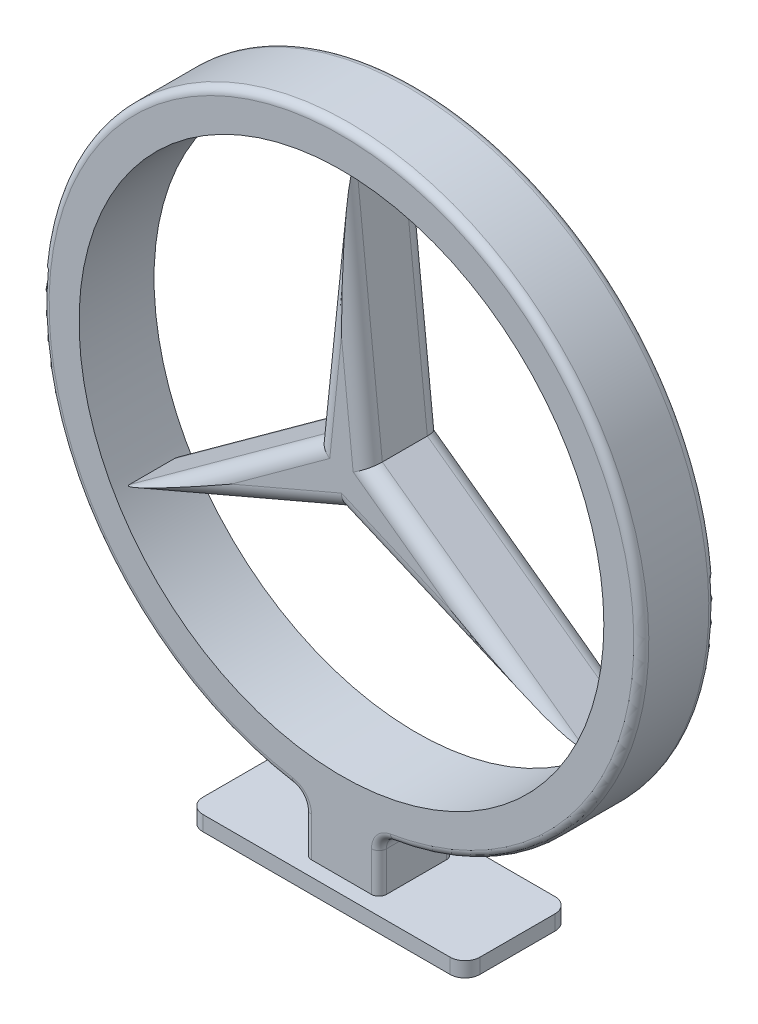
ISO-10303-21;
HEADER;
FILE_DESCRIPTION(('STEP AP214'),'2;1');
FILE_NAME('part.step','',(''),(''),'','','');
FILE_SCHEMA(('AUTOMOTIVE_DESIGN { 1 0 10303 214 1 1 1 1 }'));
ENDSEC;
DATA;
#1=APPLICATION_CONTEXT('core data for automotive mechanical design processes');
#2=APPLICATION_PROTOCOL_DEFINITION('international standard','automotive_design',2000,#1);
#3=PRODUCT_CONTEXT('',#1,'mechanical');
#4=PRODUCT('Part','Part','',(#3));
#5=PRODUCT_RELATED_PRODUCT_CATEGORY('part','',(#4));
#6=PRODUCT_DEFINITION_FORMATION('','',#4);
#7=PRODUCT_DEFINITION_CONTEXT('part definition',#1,'design');
#8=PRODUCT_DEFINITION('design','',#6,#7);
#9=PRODUCT_DEFINITION_SHAPE('','',#8);
#10=(LENGTH_UNIT() NAMED_UNIT(*) SI_UNIT(.MILLI.,.METRE.));
#11=(NAMED_UNIT(*) PLANE_ANGLE_UNIT() SI_UNIT($,.RADIAN.));
#12=(NAMED_UNIT(*) SI_UNIT($,.STERADIAN.) SOLID_ANGLE_UNIT());
#13=UNCERTAINTY_MEASURE_WITH_UNIT(LENGTH_MEASURE(1.E-05),#10,'distance_accuracy_value','');
#14=(GEOMETRIC_REPRESENTATION_CONTEXT(3) GLOBAL_UNCERTAINTY_ASSIGNED_CONTEXT((#13)) GLOBAL_UNIT_ASSIGNED_CONTEXT((#10,
#11,#12)) REPRESENTATION_CONTEXT('',''));
#15=CARTESIAN_POINT('',(0.,0.,0.));
#16=DIRECTION('',(0.,0.,1.));
#17=DIRECTION('',(1.,0.,0.));
#18=AXIS2_PLACEMENT_3D('',#15,#16,#17);
#19=CARTESIAN_POINT('',(-30.3108891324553,-17.5000000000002,-80.1950746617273));
#20=DIRECTION('',(-0.587398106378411,0.809298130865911,0.));
#21=DIRECTION('',(-0.809298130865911,-0.587398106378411,0.));
#22=AXIS2_PLACEMENT_3D('',#19,#20,#21);
#23=PLANE('',#22);
#24=DIRECTION('',(0.,0.,1.));
#25=VECTOR('',#24,1.);
#26=CARTESIAN_POINT('',(-3.45313926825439,1.99367088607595,-80.1950746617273));
#27=LINE('',#26,#25);
#28=CARTESIAN_POINT('',(-3.45313926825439,1.99367088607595,2.));
#29=VERTEX_POINT('',#28);
#30=CARTESIAN_POINT('',(-3.45313926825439,1.99367088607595,7.99999999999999));
#31=VERTEX_POINT('',#30);
#32=EDGE_CURVE('E156',#29,#31,#27,.T.);
#33=ORIENTED_EDGE('',*,*,#32,.F.);
#34=DIRECTION('',(0.809298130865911,0.587398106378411,0.));
#35=VECTOR('',#34,1.);
#36=CARTESIAN_POINT('',(-30.3108891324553,-17.5000000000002,2.));
#37=LINE('',#36,#35);
#38=CARTESIAN_POINT('',(-30.3108891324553,-17.5000000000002,2.));
#39=VERTEX_POINT('',#38);
#40=EDGE_CURVE('E176',#29,#39,#37,.F.);
#41=ORIENTED_EDGE('',*,*,#40,.T.);
#42=DIRECTION('',(0.,0.,1.));
#43=VECTOR('',#42,1.);
#44=CARTESIAN_POINT('',(-30.3108891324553,-17.5000000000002,-80.1950746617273));
#45=LINE('',#44,#43);
#46=CARTESIAN_POINT('',(-30.3108891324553,-17.5000000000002,7.99999999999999));
#47=VERTEX_POINT('',#46);
#48=EDGE_CURVE('E210',#39,#47,#45,.T.);
#49=ORIENTED_EDGE('',*,*,#48,.T.);
#50=DIRECTION('',(-0.809298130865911,-0.587398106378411,0.));
#51=VECTOR('',#50,1.);
#52=CARTESIAN_POINT('',(-3.45313926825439,1.99367088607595,8.));
#53=LINE('',#52,#51);
#54=EDGE_CURVE('E174',#47,#31,#53,.F.);
#55=ORIENTED_EDGE('',*,*,#54,.T.);
#56=EDGE_LOOP('',(#33,#41,#49,#55));
#57=FACE_BOUND('',#56,.T.);
#58=ADVANCED_FACE('F47',(#57),#23,.T.);
#59=CARTESIAN_POINT('',(0.,35.,-80.1950746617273));
#60=DIRECTION('',(-0.994571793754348,0.104052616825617,0.));
#61=DIRECTION('',(-0.104052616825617,-0.994571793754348,0.));
#62=AXIS2_PLACEMENT_3D('',#59,#60,#61);
#63=PLANE('',#62);
#64=DIRECTION('',(0.,0.,1.));
#65=VECTOR('',#64,1.);
#66=CARTESIAN_POINT('',(0.,35.,-80.1950746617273));
#67=LINE('',#66,#65);
#68=CARTESIAN_POINT('',(0.,35.,2.));
#69=VERTEX_POINT('',#68);
#70=CARTESIAN_POINT('',(0.,35.,7.99999999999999));
#71=VERTEX_POINT('',#70);
#72=EDGE_CURVE('E239',#69,#71,#67,.T.);
#73=ORIENTED_EDGE('',*,*,#72,.F.);
#74=DIRECTION('',(0.104052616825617,0.994571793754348,0.));
#75=VECTOR('',#74,1.);
#76=CARTESIAN_POINT('',(-3.45313926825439,1.99367088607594,2.));
#77=LINE('',#76,#75);
#78=EDGE_CURVE('E172',#69,#29,#77,.F.);
#79=ORIENTED_EDGE('',*,*,#78,.T.);
#80=ORIENTED_EDGE('',*,*,#32,.T.);
#81=DIRECTION('',(-0.104052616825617,-0.994571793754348,0.));
#82=VECTOR('',#81,1.);
#83=CARTESIAN_POINT('',(0.,35.,8.));
#84=LINE('',#83,#82);
#85=EDGE_CURVE('E170',#31,#71,#84,.F.);
#86=ORIENTED_EDGE('',*,*,#85,.T.);
#87=EDGE_LOOP('',(#73,#79,#80,#86));
#88=FACE_BOUND('',#87,.T.);
#89=ADVANCED_FACE('F238',(#88),#63,.T.);
#90=CARTESIAN_POINT('',(0.,35.,-80.1950746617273));
#91=DIRECTION('',(0.994571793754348,0.104052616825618,0.));
#92=DIRECTION('',(-0.104052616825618,0.994571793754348,0.));
#93=AXIS2_PLACEMENT_3D('',#90,#91,#92);
#94=PLANE('',#93);
#95=DIRECTION('',(0.,0.,1.));
#96=VECTOR('',#95,1.);
#97=CARTESIAN_POINT('',(3.45313926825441,1.99367088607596,-80.1950746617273));
#98=LINE('',#97,#96);
#99=CARTESIAN_POINT('',(3.45313926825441,1.99367088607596,2.));
#100=VERTEX_POINT('',#99);
#101=CARTESIAN_POINT('',(3.45313926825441,1.99367088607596,7.99999999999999));
#102=VERTEX_POINT('',#101);
#103=EDGE_CURVE('E245',#100,#102,#98,.T.);
#104=ORIENTED_EDGE('',*,*,#103,.F.);
#105=DIRECTION('',(0.104052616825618,-0.994571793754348,0.));
#106=VECTOR('',#105,1.);
#107=CARTESIAN_POINT('',(0.,35.,2.));
#108=LINE('',#107,#106);
#109=EDGE_CURVE('E143',#100,#69,#108,.F.);
#110=ORIENTED_EDGE('',*,*,#109,.T.);
#111=ORIENTED_EDGE('',*,*,#72,.T.);
#112=DIRECTION('',(-0.104052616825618,0.994571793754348,0.));
#113=VECTOR('',#112,1.);
#114=CARTESIAN_POINT('',(3.45313926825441,1.99367088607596,8.));
#115=LINE('',#114,#113);
#116=EDGE_CURVE('E162',#71,#102,#115,.F.);
#117=ORIENTED_EDGE('',*,*,#116,.T.);
#118=EDGE_LOOP('',(#104,#110,#111,#117));
#119=FACE_BOUND('',#118,.T.);
#120=ADVANCED_FACE('F243',(#119),#94,.T.);
#121=CARTESIAN_POINT('',(3.45313926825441,1.99367088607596,-80.1950746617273));
#122=DIRECTION('',(0.587398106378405,0.809298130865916,0.));
#123=DIRECTION('',(-0.809298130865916,0.587398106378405,0.));
#124=AXIS2_PLACEMENT_3D('',#121,#122,#123);
#125=PLANE('',#124);
#126=DIRECTION('',(0.,0.,1.));
#127=VECTOR('',#126,1.);
#128=CARTESIAN_POINT('',(30.3108891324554,-17.4999999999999,-80.1950746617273));
#129=LINE('',#128,#127);
#130=CARTESIAN_POINT('',(30.3108891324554,-17.4999999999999,2.));
#131=VERTEX_POINT('',#130);
#132=CARTESIAN_POINT('',(30.3108891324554,-17.4999999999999,7.99999999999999));
#133=VERTEX_POINT('',#132);
#134=EDGE_CURVE('E248',#131,#133,#129,.T.);
#135=ORIENTED_EDGE('',*,*,#134,.F.);
#136=DIRECTION('',(0.809298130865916,-0.587398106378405,0.));
#137=VECTOR('',#136,1.);
#138=CARTESIAN_POINT('',(3.45313926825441,1.99367088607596,2.));
#139=LINE('',#138,#137);
#140=EDGE_CURVE('E189',#131,#100,#139,.F.);
#141=ORIENTED_EDGE('',*,*,#140,.T.);
#142=ORIENTED_EDGE('',*,*,#103,.T.);
#143=DIRECTION('',(-0.809298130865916,0.587398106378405,0.));
#144=VECTOR('',#143,1.);
#145=CARTESIAN_POINT('',(30.3108891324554,-17.4999999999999,8.));
#146=LINE('',#145,#144);
#147=EDGE_CURVE('E187',#102,#133,#146,.F.);
#148=ORIENTED_EDGE('',*,*,#147,.T.);
#149=EDGE_LOOP('',(#135,#141,#142,#148));
#150=FACE_BOUND('',#149,.T.);
#151=ADVANCED_FACE('F288',(#150),#125,.T.);
#152=CARTESIAN_POINT('',(0.,-4.5,-80.1950746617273));
#153=DIRECTION('',(-0.394165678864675,-0.919039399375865,0.));
#154=DIRECTION('',(0.919039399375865,-0.394165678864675,0.));
#155=AXIS2_PLACEMENT_3D('',#152,#153,#154);
#156=PLANE('',#155);
#157=DIRECTION('',(0.,0.,1.));
#158=VECTOR('',#157,1.);
#159=CARTESIAN_POINT('',(0.,-4.5,-80.1950746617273));
#160=LINE('',#159,#158);
#161=CARTESIAN_POINT('',(0.,-4.5,2.));
#162=VERTEX_POINT('',#161);
#163=CARTESIAN_POINT('',(0.,-4.5,7.99999999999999));
#164=VERTEX_POINT('',#163);
#165=EDGE_CURVE('E253',#162,#164,#160,.T.);
#166=ORIENTED_EDGE('',*,*,#165,.F.);
#167=DIRECTION('',(-0.919039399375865,0.394165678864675,0.));
#168=VECTOR('',#167,1.);
#169=CARTESIAN_POINT('',(30.3108891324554,-17.4999999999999,2.));
#170=LINE('',#169,#168);
#171=EDGE_CURVE('E185',#162,#131,#170,.F.);
#172=ORIENTED_EDGE('',*,*,#171,.T.);
#173=ORIENTED_EDGE('',*,*,#134,.T.);
#174=DIRECTION('',(0.919039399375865,-0.394165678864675,0.));
#175=VECTOR('',#174,1.);
#176=CARTESIAN_POINT('',(0.,-4.5,8.));
#177=LINE('',#176,#175);
#178=EDGE_CURVE('E182',#133,#164,#177,.F.);
#179=ORIENTED_EDGE('',*,*,#178,.T.);
#180=EDGE_LOOP('',(#166,#172,#173,#179));
#181=FACE_BOUND('',#180,.T.);
#182=ADVANCED_FACE('F285',(#181),#156,.T.);
#183=CARTESIAN_POINT('',(-30.3108891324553,-17.5000000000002,-80.1950746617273));
#184=DIRECTION('',(0.394165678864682,-0.919039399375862,0.));
#185=DIRECTION('',(0.919039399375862,0.394165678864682,0.));
#186=AXIS2_PLACEMENT_3D('',#183,#184,#185);
#187=PLANE('',#186);
#188=ORIENTED_EDGE('',*,*,#48,.F.);
#189=DIRECTION('',(-0.919039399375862,-0.394165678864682,0.));
#190=VECTOR('',#189,1.);
#191=CARTESIAN_POINT('',(0.,-4.5,2.));
#192=LINE('',#191,#190);
#193=EDGE_CURVE('E180',#39,#162,#192,.F.);
#194=ORIENTED_EDGE('',*,*,#193,.T.);
#195=ORIENTED_EDGE('',*,*,#165,.T.);
#196=DIRECTION('',(0.919039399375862,0.394165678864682,0.));
#197=VECTOR('',#196,1.);
#198=CARTESIAN_POINT('',(-30.3108891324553,-17.5000000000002,8.));
#199=LINE('',#198,#197);
#200=EDGE_CURVE('E178',#164,#47,#199,.F.);
#201=ORIENTED_EDGE('',*,*,#200,.T.);
#202=EDGE_LOOP('',(#188,#194,#195,#201));
#203=FACE_BOUND('',#202,.T.);
#204=ADVANCED_FACE('F274',(#203),#187,.T.);
#205=CARTESIAN_POINT('',(0.,0.,10.));
#206=DIRECTION('',(0.,0.,-1.));
#207=DIRECTION('',(-1.,0.,0.));
#208=AXIS2_PLACEMENT_3D('',#205,#206,#207);
#209=PLANE('',#208);
#210=DIRECTION('',(0.919039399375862,0.394165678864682,0.));
#211=VECTOR('',#210,1.);
#212=CARTESIAN_POINT('',(-0.78833135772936,-2.66192120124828,10.));
#213=LINE('',#212,#211);
#214=CARTESIAN_POINT('',(-14.6588092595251,-8.61081342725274,10.));
#215=VERTEX_POINT('',#214);
#216=CARTESIAN_POINT('',(0.,-2.3238147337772,10.));
#217=VERTEX_POINT('',#216);
#218=EDGE_CURVE('E56',#215,#217,#213,.T.);
#219=ORIENTED_EDGE('',*,*,#218,.T.);
#220=DIRECTION('',(0.919039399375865,-0.394165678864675,0.));
#221=VECTOR('',#220,1.);
#222=CARTESIAN_POINT('',(31.0992204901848,-15.6619212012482,10.));
#223=LINE('',#222,#221);
#224=CARTESIAN_POINT('',(14.6588092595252,-8.61081342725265,10.));
#225=VERTEX_POINT('',#224);
#226=EDGE_CURVE('E12',#217,#225,#223,.T.);
#227=ORIENTED_EDGE('',*,*,#226,.T.);
#228=DIRECTION('',(-0.809298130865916,0.587398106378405,0.));
#229=VECTOR('',#228,1.);
#230=CARTESIAN_POINT('',(2.2783430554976,0.375074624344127,10.));
#231=LINE('',#230,#229);
#232=CARTESIAN_POINT('',(1.55676943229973,0.898801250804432,10.));
#233=VERTEX_POINT('',#232);
#234=EDGE_CURVE('E191',#225,#233,#231,.T.);
#235=ORIENTED_EDGE('',*,*,#234,.T.);
#236=DIRECTION('',(-0.104052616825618,0.994571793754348,0.));
#237=VECTOR('',#236,1.);
#238=CARTESIAN_POINT('',(-1.9891435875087,34.7918947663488,10.));
#239=LINE('',#238,#237);
#240=CARTESIAN_POINT('',(0.,15.7789552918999,10.));
#241=VERTEX_POINT('',#240);
#242=EDGE_CURVE('E193',#233,#241,#239,.T.);
#243=ORIENTED_EDGE('',*,*,#242,.T.);
#244=DIRECTION('',(-0.104052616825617,-0.994571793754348,0.));
#245=VECTOR('',#244,1.);
#246=CARTESIAN_POINT('',(-1.46399568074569,1.78556565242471,10.));
#247=LINE('',#246,#245);
#248=CARTESIAN_POINT('',(-1.55676943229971,0.89880125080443,10.));
#249=VERTEX_POINT('',#248);
#250=EDGE_CURVE('E195',#241,#249,#247,.T.);
#251=ORIENTED_EDGE('',*,*,#250,.T.);
#252=DIRECTION('',(-0.809298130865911,-0.587398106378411,0.));
#253=VECTOR('',#252,1.);
#254=CARTESIAN_POINT('',(-29.1360929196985,-19.118596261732,10.));
#255=LINE('',#254,#253);
#256=EDGE_CURVE('E67',#249,#215,#255,.T.);
#257=ORIENTED_EDGE('',*,*,#256,.T.);
#258=EDGE_LOOP('',(#219,#227,#235,#243,#251,#257));
#259=FACE_BOUND('',#258,.T.);
#260=ADVANCED_FACE('F406',(#259),#209,.F.);
#261=CARTESIAN_POINT('',(0.,0.,0.));
#262=DIRECTION('',(0.,0.,1.));
#263=DIRECTION('',(1.,0.,0.));
#264=AXIS2_PLACEMENT_3D('',#261,#262,#263);
#265=PLANE('',#264);
#266=DIRECTION('',(0.104052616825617,0.994571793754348,0.));
#267=VECTOR('',#266,1.);
#268=CARTESIAN_POINT('',(1.9891435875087,34.7918947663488,0.));
#269=LINE('',#268,#267);
#270=CARTESIAN_POINT('',(-1.55676943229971,0.89880125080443,0.));
#271=VERTEX_POINT('',#270);
#272=CARTESIAN_POINT('',(0.,15.7789552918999,0.));
#273=VERTEX_POINT('',#272);
#274=EDGE_CURVE('E160',#271,#273,#269,.T.);
#275=ORIENTED_EDGE('',*,*,#274,.T.);
#276=DIRECTION('',(0.104052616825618,-0.994571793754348,0.));
#277=VECTOR('',#276,1.);
#278=CARTESIAN_POINT('',(1.46399568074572,1.78556565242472,0.));
#279=LINE('',#278,#277);
#280=CARTESIAN_POINT('',(1.55676943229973,0.898801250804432,0.));
#281=VERTEX_POINT('',#280);
#282=EDGE_CURVE('E141',#273,#281,#279,.T.);
#283=ORIENTED_EDGE('',*,*,#282,.T.);
#284=DIRECTION('',(0.809298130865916,-0.587398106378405,0.));
#285=VECTOR('',#284,1.);
#286=CARTESIAN_POINT('',(29.1360929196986,-19.1185962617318,0.));
#287=LINE('',#286,#285);
#288=CARTESIAN_POINT('',(14.6588092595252,-8.61081342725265,0.));
#289=VERTEX_POINT('',#288);
#290=EDGE_CURVE('E149',#281,#289,#287,.T.);
#291=ORIENTED_EDGE('',*,*,#290,.T.);
#292=DIRECTION('',(-0.919039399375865,0.394165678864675,0.));
#293=VECTOR('',#292,1.);
#294=CARTESIAN_POINT('',(0.788331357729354,-2.66192120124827,0.));
#295=LINE('',#294,#293);
#296=CARTESIAN_POINT('',(0.,-2.3238147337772,0.));
#297=VERTEX_POINT('',#296);
#298=EDGE_CURVE('E155',#289,#297,#295,.T.);
#299=ORIENTED_EDGE('',*,*,#298,.T.);
#300=DIRECTION('',(-0.919039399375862,-0.394165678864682,0.));
#301=VECTOR('',#300,1.);
#302=CARTESIAN_POINT('',(-31.0992204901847,-15.6619212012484,0.));
#303=LINE('',#302,#301);
#304=CARTESIAN_POINT('',(-14.6588092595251,-8.61081342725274,0.));
#305=VERTEX_POINT('',#304);
#306=EDGE_CURVE('E259',#297,#305,#303,.T.);
#307=ORIENTED_EDGE('',*,*,#306,.T.);
#308=DIRECTION('',(0.809298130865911,0.587398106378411,0.));
#309=VECTOR('',#308,1.);
#310=CARTESIAN_POINT('',(-2.27834305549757,0.375074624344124,0.));
#311=LINE('',#310,#309);
#312=EDGE_CURVE('E165',#305,#271,#311,.T.);
#313=ORIENTED_EDGE('',*,*,#312,.T.);
#314=EDGE_LOOP('',(#275,#283,#291,#299,#307,#313));
#315=FACE_BOUND('',#314,.T.);
#316=ADVANCED_FACE('F158',(#315),#265,.F.);
#317=CARTESIAN_POINT('',(0.841810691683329,-1.96277158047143,2.));
#318=DIRECTION('',(0.919039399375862,0.394165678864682,0.));
#319=DIRECTION('',(-0.394165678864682,0.919039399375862,0.));
#320=AXIS2_PLACEMENT_3D('',#317,#318,#319);
#321=CYLINDRICAL_SURFACE('',#320,2.);
#322=CARTESIAN_POINT('',(0.,-2.3238147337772,2.));
#323=DIRECTION('',(1.,0.,0.));
#324=DIRECTION('',(0.,1.,0.));
#325=AXIS2_PLACEMENT_3D('',#322,#323,#324);
#326=ELLIPSE('',#325,2.17618526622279,2.);
#327=EDGE_CURVE('E204',#162,#297,#326,.T.);
#328=ORIENTED_EDGE('',*,*,#327,.F.);
#329=ORIENTED_EDGE('',*,*,#193,.F.);
#330=CARTESIAN_POINT('',(-14.6588092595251,-8.61081342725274,2.));
#331=DIRECTION('',(0.493839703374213,-0.869552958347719,0.));
#332=DIRECTION('',(0.869552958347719,0.493839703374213,0.));
#333=AXIS2_PLACEMENT_3D('',#330,#331,#332);
#334=ELLIPSE('',#333,18.0001456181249,2.);
#335=EDGE_CURVE('E207',#305,#39,#334,.F.);
#336=ORIENTED_EDGE('',*,*,#335,.F.);
#337=ORIENTED_EDGE('',*,*,#306,.F.);
#338=EDGE_LOOP('',(#328,#329,#336,#337));
#339=FACE_BOUND('',#338,.T.);
#340=ADVANCED_FACE('F279',(#339),#321,.T.);
#341=CARTESIAN_POINT('',(-0.964414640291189,1.32873932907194,2.));
#342=DIRECTION('',(-0.809298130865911,-0.587398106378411,0.));
#343=DIRECTION('',(0.587398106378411,-0.809298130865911,0.));
#344=AXIS2_PLACEMENT_3D('',#341,#342,#343);
#345=CYLINDRICAL_SURFACE('',#344,2.);
#346=ORIENTED_EDGE('',*,*,#335,.T.);
#347=ORIENTED_EDGE('',*,*,#40,.F.);
#348=CARTESIAN_POINT('',(-1.55676943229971,0.898801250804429,2.));
#349=DIRECTION('',(-0.499999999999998,-0.86602540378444,0.));
#350=DIRECTION('',(0.86602540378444,-0.499999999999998,0.));
#351=AXIS2_PLACEMENT_3D('',#348,#349,#350);
#352=ELLIPSE('',#351,2.18973927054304,2.);
#353=EDGE_CURVE('E201',#271,#29,#352,.F.);
#354=ORIENTED_EDGE('',*,*,#353,.F.);
#355=ORIENTED_EDGE('',*,*,#312,.F.);
#356=EDGE_LOOP('',(#346,#347,#354,#355));
#357=FACE_BOUND('',#356,.T.);
#358=ADVANCED_FACE('F266',(#357),#345,.T.);
#359=CARTESIAN_POINT('',(-0.841810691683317,-1.96277158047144,2.));
#360=DIRECTION('',(0.919039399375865,-0.394165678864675,0.));
#361=DIRECTION('',(0.394165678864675,0.919039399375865,0.));
#362=AXIS2_PLACEMENT_3D('',#359,#360,#361);
#363=CYLINDRICAL_SURFACE('',#362,2.);
#364=ORIENTED_EDGE('',*,*,#327,.T.);
#365=ORIENTED_EDGE('',*,*,#298,.F.);
#366=CARTESIAN_POINT('',(14.6588092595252,-8.61081342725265,2.));
#367=DIRECTION('',(0.493839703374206,0.869552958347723,0.));
#368=DIRECTION('',(-0.869552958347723,0.493839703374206,0.));
#369=AXIS2_PLACEMENT_3D('',#366,#367,#368);
#370=ELLIPSE('',#369,18.0001456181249,2.);
#371=EDGE_CURVE('E152',#131,#289,#370,.T.);
#372=ORIENTED_EDGE('',*,*,#371,.F.);
#373=ORIENTED_EDGE('',*,*,#171,.F.);
#374=EDGE_LOOP('',(#364,#365,#372,#373));
#375=FACE_BOUND('',#374,.T.);
#376=ADVANCED_FACE('F282',(#375),#363,.T.);
#377=CARTESIAN_POINT('',(-1.63292933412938,0.17083791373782,2.));
#378=DIRECTION('',(-0.104052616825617,-0.994571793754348,0.));
#379=DIRECTION('',(0.994571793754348,-0.104052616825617,0.));
#380=AXIS2_PLACEMENT_3D('',#377,#378,#379);
#381=CYLINDRICAL_SURFACE('',#380,2.);
#382=ORIENTED_EDGE('',*,*,#353,.T.);
#383=ORIENTED_EDGE('',*,*,#78,.F.);
#384=CARTESIAN_POINT('',(0.,15.7789552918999,2.));
#385=DIRECTION('',(-1.,0.,0.));
#386=DIRECTION('',(0.,-1.,0.));
#387=AXIS2_PLACEMENT_3D('',#384,#385,#386);
#388=ELLIPSE('',#387,19.2210447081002,2.);
#389=EDGE_CURVE('E146',#273,#69,#388,.F.);
#390=ORIENTED_EDGE('',*,*,#389,.F.);
#391=ORIENTED_EDGE('',*,*,#274,.F.);
#392=EDGE_LOOP('',(#382,#383,#390,#391));
#393=FACE_BOUND('',#392,.T.);
#394=ADVANCED_FACE('F269',(#393),#381,.T.);
#395=CARTESIAN_POINT('',(0.964414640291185,1.32873932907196,2.));
#396=DIRECTION('',(-0.809298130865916,0.587398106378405,0.));
#397=DIRECTION('',(-0.587398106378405,-0.809298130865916,0.));
#398=AXIS2_PLACEMENT_3D('',#395,#396,#397);
#399=CYLINDRICAL_SURFACE('',#398,2.);
#400=ORIENTED_EDGE('',*,*,#371,.T.);
#401=ORIENTED_EDGE('',*,*,#290,.F.);
#402=CARTESIAN_POINT('',(1.55676943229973,0.898801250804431,2.));
#403=DIRECTION('',(-0.500000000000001,0.866025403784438,0.));
#404=DIRECTION('',(0.866025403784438,0.500000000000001,0.));
#405=AXIS2_PLACEMENT_3D('',#402,#403,#404);
#406=ELLIPSE('',#405,2.18973927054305,2.);
#407=EDGE_CURVE('E137',#100,#281,#406,.T.);
#408=ORIENTED_EDGE('',*,*,#407,.F.);
#409=ORIENTED_EDGE('',*,*,#140,.F.);
#410=EDGE_LOOP('',(#400,#401,#408,#409));
#411=FACE_BOUND('',#410,.T.);
#412=ADVANCED_FACE('F150',(#411),#399,.T.);
#413=CARTESIAN_POINT('',(1.6329293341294,0.170837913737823,2.));
#414=DIRECTION('',(-0.104052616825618,0.994571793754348,0.));
#415=DIRECTION('',(-0.994571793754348,-0.104052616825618,0.));
#416=AXIS2_PLACEMENT_3D('',#413,#414,#415);
#417=CYLINDRICAL_SURFACE('',#416,2.);
#418=ORIENTED_EDGE('',*,*,#389,.T.);
#419=ORIENTED_EDGE('',*,*,#109,.F.);
#420=ORIENTED_EDGE('',*,*,#407,.T.);
#421=ORIENTED_EDGE('',*,*,#282,.F.);
#422=EDGE_LOOP('',(#418,#419,#420,#421));
#423=FACE_BOUND('',#422,.T.);
#424=ADVANCED_FACE('F139',(#423),#417,.T.);
#425=CARTESIAN_POINT('',(-1.63292933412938,0.17083791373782,8.));
#426=DIRECTION('',(0.104052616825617,0.994571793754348,0.));
#427=DIRECTION('',(-0.994571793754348,0.104052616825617,0.));
#428=AXIS2_PLACEMENT_3D('',#425,#426,#427);
#429=CYLINDRICAL_SURFACE('',#428,2.);
#430=CARTESIAN_POINT('',(0.,15.7789552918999,8.));
#431=DIRECTION('',(1.,0.,0.));
#432=DIRECTION('',(0.,-1.,0.));
#433=AXIS2_PLACEMENT_3D('',#430,#431,#432);
#434=ELLIPSE('',#433,19.2210447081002,2.);
#435=EDGE_CURVE('E220',#71,#241,#434,.T.);
#436=ORIENTED_EDGE('',*,*,#435,.F.);
#437=ORIENTED_EDGE('',*,*,#85,.F.);
#438=CARTESIAN_POINT('',(-1.55676943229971,0.898801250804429,8.));
#439=DIRECTION('',(0.499999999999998,0.86602540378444,0.));
#440=DIRECTION('',(0.86602540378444,-0.499999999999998,0.));
#441=AXIS2_PLACEMENT_3D('',#438,#439,#440);
#442=ELLIPSE('',#441,2.18973927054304,2.);
#443=EDGE_CURVE('E51',#249,#31,#442,.F.);
#444=ORIENTED_EDGE('',*,*,#443,.F.);
#445=ORIENTED_EDGE('',*,*,#250,.F.);
#446=EDGE_LOOP('',(#436,#437,#444,#445));
#447=FACE_BOUND('',#446,.T.);
#448=ADVANCED_FACE('F49',(#447),#429,.T.);
#449=CARTESIAN_POINT('',(-0.964414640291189,1.32873932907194,8.));
#450=DIRECTION('',(0.809298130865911,0.587398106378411,0.));
#451=DIRECTION('',(-0.587398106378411,0.809298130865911,0.));
#452=AXIS2_PLACEMENT_3D('',#449,#450,#451);
#453=CYLINDRICAL_SURFACE('',#452,2.);
#454=ORIENTED_EDGE('',*,*,#443,.T.);
#455=ORIENTED_EDGE('',*,*,#54,.F.);
#456=CARTESIAN_POINT('',(-14.6588092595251,-8.61081342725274,8.));
#457=DIRECTION('',(-0.493839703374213,0.869552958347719,0.));
#458=DIRECTION('',(0.869552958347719,0.493839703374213,0.));
#459=AXIS2_PLACEMENT_3D('',#456,#457,#458);
#460=ELLIPSE('',#459,18.0001456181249,2.);
#461=EDGE_CURVE('E218',#215,#47,#460,.F.);
#462=ORIENTED_EDGE('',*,*,#461,.F.);
#463=ORIENTED_EDGE('',*,*,#256,.F.);
#464=EDGE_LOOP('',(#454,#455,#462,#463));
#465=FACE_BOUND('',#464,.T.);
#466=ADVANCED_FACE('F230',(#465),#453,.T.);
#467=CARTESIAN_POINT('',(1.6329293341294,0.170837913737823,8.));
#468=DIRECTION('',(0.104052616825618,-0.994571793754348,0.));
#469=DIRECTION('',(0.994571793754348,0.104052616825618,0.));
#470=AXIS2_PLACEMENT_3D('',#467,#468,#469);
#471=CYLINDRICAL_SURFACE('',#470,2.);
#472=ORIENTED_EDGE('',*,*,#435,.T.);
#473=ORIENTED_EDGE('',*,*,#242,.F.);
#474=CARTESIAN_POINT('',(1.55676943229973,0.898801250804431,8.));
#475=DIRECTION('',(0.500000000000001,-0.866025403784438,0.));
#476=DIRECTION('',(-0.866025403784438,-0.500000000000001,0.));
#477=AXIS2_PLACEMENT_3D('',#474,#475,#476);
#478=ELLIPSE('',#477,2.18973927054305,2.);
#479=EDGE_CURVE('E215',#102,#233,#478,.T.);
#480=ORIENTED_EDGE('',*,*,#479,.F.);
#481=ORIENTED_EDGE('',*,*,#116,.F.);
#482=EDGE_LOOP('',(#472,#473,#480,#481));
#483=FACE_BOUND('',#482,.T.);
#484=ADVANCED_FACE('F301',(#483),#471,.T.);
#485=CARTESIAN_POINT('',(0.841810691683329,-1.96277158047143,8.));
#486=DIRECTION('',(-0.919039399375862,-0.394165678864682,0.));
#487=DIRECTION('',(0.394165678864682,-0.919039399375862,0.));
#488=AXIS2_PLACEMENT_3D('',#485,#486,#487);
#489=CYLINDRICAL_SURFACE('',#488,2.);
#490=ORIENTED_EDGE('',*,*,#461,.T.);
#491=ORIENTED_EDGE('',*,*,#200,.F.);
#492=CARTESIAN_POINT('',(0.,-2.3238147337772,8.));
#493=DIRECTION('',(-1.,0.,0.));
#494=DIRECTION('',(0.,1.,0.));
#495=AXIS2_PLACEMENT_3D('',#492,#493,#494);
#496=ELLIPSE('',#495,2.17618526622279,2.);
#497=EDGE_CURVE('E213',#217,#164,#496,.F.);
#498=ORIENTED_EDGE('',*,*,#497,.F.);
#499=ORIENTED_EDGE('',*,*,#218,.F.);
#500=EDGE_LOOP('',(#490,#491,#498,#499));
#501=FACE_BOUND('',#500,.T.);
#502=ADVANCED_FACE('F299',(#501),#489,.T.);
#503=CARTESIAN_POINT('',(0.964414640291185,1.32873932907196,8.));
#504=DIRECTION('',(0.809298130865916,-0.587398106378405,0.));
#505=DIRECTION('',(0.587398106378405,0.809298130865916,0.));
#506=AXIS2_PLACEMENT_3D('',#503,#504,#505);
#507=CYLINDRICAL_SURFACE('',#506,2.);
#508=ORIENTED_EDGE('',*,*,#479,.T.);
#509=ORIENTED_EDGE('',*,*,#234,.F.);
#510=CARTESIAN_POINT('',(14.6588092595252,-8.61081342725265,8.));
#511=DIRECTION('',(-0.493839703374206,-0.869552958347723,0.));
#512=DIRECTION('',(0.869552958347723,-0.493839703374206,0.));
#513=AXIS2_PLACEMENT_3D('',#510,#511,#512);
#514=ELLIPSE('',#513,18.0001456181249,2.);
#515=EDGE_CURVE('E211',#133,#225,#514,.T.);
#516=ORIENTED_EDGE('',*,*,#515,.F.);
#517=ORIENTED_EDGE('',*,*,#147,.F.);
#518=EDGE_LOOP('',(#508,#509,#516,#517));
#519=FACE_BOUND('',#518,.T.);
#520=ADVANCED_FACE('F293',(#519),#507,.T.);
#521=CARTESIAN_POINT('',(-0.841810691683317,-1.96277158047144,8.));
#522=DIRECTION('',(-0.919039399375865,0.394165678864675,0.));
#523=DIRECTION('',(-0.394165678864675,-0.919039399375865,0.));
#524=AXIS2_PLACEMENT_3D('',#521,#522,#523);
#525=CYLINDRICAL_SURFACE('',#524,2.);
#526=ORIENTED_EDGE('',*,*,#497,.T.);
#527=ORIENTED_EDGE('',*,*,#178,.F.);
#528=ORIENTED_EDGE('',*,*,#515,.T.);
#529=ORIENTED_EDGE('',*,*,#226,.F.);
#530=EDGE_LOOP('',(#526,#527,#528,#529));
#531=FACE_BOUND('',#530,.T.);
#532=ADVANCED_FACE('F297',(#531),#525,.T.);
#533=CLOSED_SHELL('',(#58,#89,#120,#151,#182,#204,#260,#316,#340,#358,#376,#394,#412,#424,#448,
#466,#484,#502,#520,#532));
#534=MANIFOLD_SOLID_BREP('B2',#533);
#535=CARTESIAN_POINT('',(-7.,-41.4125584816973,10.));
#536=DIRECTION('',(0.,0.,-1.));
#537=DIRECTION('',(-1.,0.,0.));
#538=AXIS2_PLACEMENT_3D('',#535,#536,#537);
#539=CYLINDRICAL_SURFACE('',#538,2.);
#540=DIRECTION('',(0.,0.,-1.));
#541=VECTOR('',#540,1.);
#542=CARTESIAN_POINT('',(-6.66666666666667,-39.4405318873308,10.));
#543=LINE('',#542,#541);
#544=CARTESIAN_POINT('',(-6.66666666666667,-39.4405318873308,0.999999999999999));
#545=VERTEX_POINT('',#544);
#546=CARTESIAN_POINT('',(-6.66666666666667,-39.4405318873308,9.));
#547=VERTEX_POINT('',#546);
#548=EDGE_CURVE('E657',#545,#547,#543,.F.);
#549=ORIENTED_EDGE('',*,*,#548,.F.);
#550=CARTESIAN_POINT('',(-7.,-41.4125584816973,0.999999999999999));
#551=DIRECTION('',(0.,0.,1.));
#552=DIRECTION('',(1.,0.,0.));
#553=AXIS2_PLACEMENT_3D('',#550,#551,#552);
#554=CIRCLE('',#553,2.);
#555=CARTESIAN_POINT('',(-5.,-41.4125584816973,0.999999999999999));
#556=VERTEX_POINT('',#555);
#557=EDGE_CURVE('E688',#545,#556,#554,.F.);
#558=ORIENTED_EDGE('',*,*,#557,.T.);
#559=DIRECTION('',(0.,0.,1.));
#560=VECTOR('',#559,1.);
#561=CARTESIAN_POINT('',(-5.,-41.4125584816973,10.));
#562=LINE('',#561,#560);
#563=CARTESIAN_POINT('',(-5.,-41.4125584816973,9.));
#564=VERTEX_POINT('',#563);
#565=EDGE_CURVE('E660',#564,#556,#562,.F.);
#566=ORIENTED_EDGE('',*,*,#565,.F.);
#567=CARTESIAN_POINT('',(-7.,-41.4125584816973,9.));
#568=DIRECTION('',(0.,0.,1.));
#569=DIRECTION('',(1.,0.,0.));
#570=AXIS2_PLACEMENT_3D('',#567,#568,#569);
#571=CIRCLE('',#570,2.);
#572=EDGE_CURVE('E686',#564,#547,#571,.T.);
#573=ORIENTED_EDGE('',*,*,#572,.T.);
#574=EDGE_LOOP('',(#549,#558,#566,#573));
#575=FACE_BOUND('',#574,.T.);
#576=ADVANCED_FACE('F463',(#575),#539,.F.);
#577=CARTESIAN_POINT('',(7.,-41.4125584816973,10.));
#578=DIRECTION('',(0.,0.,-1.));
#579=DIRECTION('',(-1.,0.,0.));
#580=AXIS2_PLACEMENT_3D('',#577,#578,#579);
#581=CYLINDRICAL_SURFACE('',#580,2.);
#582=DIRECTION('',(0.,0.,1.));
#583=VECTOR('',#582,1.);
#584=CARTESIAN_POINT('',(5.,-41.4125584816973,10.));
#585=LINE('',#584,#583);
#586=CARTESIAN_POINT('',(5.,-41.4125584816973,0.999999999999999));
#587=VERTEX_POINT('',#586);
#588=CARTESIAN_POINT('',(5.,-41.4125584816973,9.));
#589=VERTEX_POINT('',#588);
#590=EDGE_CURVE('E654',#587,#589,#585,.T.);
#591=ORIENTED_EDGE('',*,*,#590,.F.);
#592=CARTESIAN_POINT('',(7.,-41.4125584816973,0.999999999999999));
#593=DIRECTION('',(0.,0.,1.));
#594=DIRECTION('',(1.,0.,0.));
#595=AXIS2_PLACEMENT_3D('',#592,#593,#594);
#596=CIRCLE('',#595,2.);
#597=CARTESIAN_POINT('',(6.66666666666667,-39.4405318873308,0.999999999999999));
#598=VERTEX_POINT('',#597);
#599=EDGE_CURVE('E680',#587,#598,#596,.F.);
#600=ORIENTED_EDGE('',*,*,#599,.T.);
#601=DIRECTION('',(0.,0.,-1.));
#602=VECTOR('',#601,1.);
#603=CARTESIAN_POINT('',(6.66666666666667,-39.4405318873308,10.));
#604=LINE('',#603,#602);
#605=CARTESIAN_POINT('',(6.66666666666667,-39.4405318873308,9.));
#606=VERTEX_POINT('',#605);
#607=EDGE_CURVE('E649',#606,#598,#604,.T.);
#608=ORIENTED_EDGE('',*,*,#607,.F.);
#609=CARTESIAN_POINT('',(7.,-41.4125584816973,9.));
#610=DIRECTION('',(0.,0.,1.));
#611=DIRECTION('',(1.,0.,0.));
#612=AXIS2_PLACEMENT_3D('',#609,#610,#611);
#613=CIRCLE('',#612,2.);
#614=EDGE_CURVE('E678',#606,#589,#613,.T.);
#615=ORIENTED_EDGE('',*,*,#614,.T.);
#616=EDGE_LOOP('',(#591,#600,#608,#615));
#617=FACE_BOUND('',#616,.T.);
#618=ADVANCED_FACE('F755',(#617),#581,.F.);
#619=CARTESIAN_POINT('',(0.,0.,10.));
#620=DIRECTION('',(0.,0.,-1.));
#621=DIRECTION('',(-1.,0.,0.));
#622=AXIS2_PLACEMENT_3D('',#619,#620,#621);
#623=CYLINDRICAL_SURFACE('',#622,40.);
#624=ORIENTED_EDGE('',*,*,#607,.T.);
#625=CARTESIAN_POINT('',(0.,0.,0.999999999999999));
#626=DIRECTION('',(0.,0.,1.));
#627=DIRECTION('',(1.,0.,0.));
#628=AXIS2_PLACEMENT_3D('',#625,#626,#627);
#629=CIRCLE('',#628,40.);
#630=EDGE_CURVE('E702',#598,#545,#629,.T.);
#631=ORIENTED_EDGE('',*,*,#630,.T.);
#632=ORIENTED_EDGE('',*,*,#548,.T.);
#633=CARTESIAN_POINT('',(0.,0.,9.));
#634=DIRECTION('',(0.,0.,1.));
#635=DIRECTION('',(1.,0.,0.));
#636=AXIS2_PLACEMENT_3D('',#633,#634,#635);
#637=CIRCLE('',#636,40.);
#638=EDGE_CURVE('E700',#547,#606,#637,.F.);
#639=ORIENTED_EDGE('',*,*,#638,.T.);
#640=EDGE_LOOP('',(#624,#631,#632,#639));
#641=FACE_BOUND('',#640,.T.);
#642=ADVANCED_FACE('F771',(#641),#623,.T.);
#643=CARTESIAN_POINT('',(-5.00000000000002,0.,10.));
#644=DIRECTION('',(1.,0.,0.));
#645=DIRECTION('',(0.,1.,0.));
#646=AXIS2_PLACEMENT_3D('',#643,#644,#645);
#647=PLANE('',#646);
#648=ORIENTED_EDGE('',*,*,#565,.T.);
#649=DIRECTION('',(0.,-1.,0.));
#650=VECTOR('',#649,1.);
#651=CARTESIAN_POINT('',(-5.00000000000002,0.,0.999999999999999));
#652=LINE('',#651,#650);
#653=CARTESIAN_POINT('',(-5.,-46.6862696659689,0.999999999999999));
#654=VERTEX_POINT('',#653);
#655=EDGE_CURVE('E684',#556,#654,#652,.T.);
#656=ORIENTED_EDGE('',*,*,#655,.T.);
#657=DIRECTION('',(0.,0.,-1.));
#658=VECTOR('',#657,1.);
#659=CARTESIAN_POINT('',(-5.,-46.6862696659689,0.));
#660=LINE('',#659,#658);
#661=CARTESIAN_POINT('',(-5.,-46.6862696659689,9.));
#662=VERTEX_POINT('',#661);
#663=EDGE_CURVE('E639',#662,#654,#660,.T.);
#664=ORIENTED_EDGE('',*,*,#663,.F.);
#665=DIRECTION('',(0.,-1.,0.));
#666=VECTOR('',#665,1.);
#667=CARTESIAN_POINT('',(-5.,-41.4125584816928,9.));
#668=LINE('',#667,#666);
#669=EDGE_CURVE('E682',#662,#564,#668,.F.);
#670=ORIENTED_EDGE('',*,*,#669,.T.);
#671=EDGE_LOOP('',(#648,#656,#664,#670));
#672=FACE_BOUND('',#671,.T.);
#673=ADVANCED_FACE('F786',(#672),#647,.F.);
#674=CARTESIAN_POINT('',(4.99999999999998,0.,10.));
#675=DIRECTION('',(-1.,0.,0.));
#676=DIRECTION('',(0.,-1.,0.));
#677=AXIS2_PLACEMENT_3D('',#674,#675,#676);
#678=PLANE('',#677);
#679=DIRECTION('',(0.,0.,1.));
#680=VECTOR('',#679,1.);
#681=CARTESIAN_POINT('',(5.,-46.6862696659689,0.));
#682=LINE('',#681,#680);
#683=CARTESIAN_POINT('',(5.,-46.6862696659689,0.999999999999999));
#684=VERTEX_POINT('',#683);
#685=CARTESIAN_POINT('',(5.,-46.6862696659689,9.));
#686=VERTEX_POINT('',#685);
#687=EDGE_CURVE('E628',#684,#686,#682,.T.);
#688=ORIENTED_EDGE('',*,*,#687,.F.);
#689=DIRECTION('',(0.,1.,0.));
#690=VECTOR('',#689,1.);
#691=CARTESIAN_POINT('',(4.99999999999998,0.,0.999999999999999));
#692=LINE('',#691,#690);
#693=EDGE_CURVE('E665',#684,#587,#692,.T.);
#694=ORIENTED_EDGE('',*,*,#693,.T.);
#695=ORIENTED_EDGE('',*,*,#590,.T.);
#696=DIRECTION('',(0.,1.,0.));
#697=VECTOR('',#696,1.);
#698=CARTESIAN_POINT('',(5.,-46.6862696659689,9.));
#699=LINE('',#698,#697);
#700=EDGE_CURVE('E663',#589,#686,#699,.F.);
#701=ORIENTED_EDGE('',*,*,#700,.T.);
#702=EDGE_LOOP('',(#688,#694,#695,#701));
#703=FACE_BOUND('',#702,.T.);
#704=ADVANCED_FACE('F757',(#703),#678,.F.);
#705=CARTESIAN_POINT('',(0.,0.,10.));
#706=DIRECTION('',(0.,0.,-1.));
#707=DIRECTION('',(-1.,0.,0.));
#708=AXIS2_PLACEMENT_3D('',#705,#706,#707);
#709=CYLINDRICAL_SURFACE('',#708,35.);
#710=CARTESIAN_POINT('',(0.,0.,10.));
#711=DIRECTION('',(0.,0.,1.));
#712=DIRECTION('',(1.,0.,0.));
#713=AXIS2_PLACEMENT_3D('',#710,#711,#712);
#714=CIRCLE('',#713,35.);
#715=CARTESIAN_POINT('',(35.,0.,10.));
#716=VERTEX_POINT('',#715);
#717=EDGE_CURVE('E646',#716,#716,#714,.T.);
#718=ORIENTED_EDGE('',*,*,#717,.T.);
#719=EDGE_LOOP('',(#718));
#720=FACE_BOUND('',#719,.T.);
#721=CARTESIAN_POINT('',(0.,0.,0.));
#722=DIRECTION('',(0.,0.,1.));
#723=DIRECTION('',(1.,0.,0.));
#724=AXIS2_PLACEMENT_3D('',#721,#722,#723);
#725=CIRCLE('',#724,35.);
#726=CARTESIAN_POINT('',(35.,0.,0.));
#727=VERTEX_POINT('',#726);
#728=EDGE_CURVE('E645',#727,#727,#725,.T.);
#729=ORIENTED_EDGE('',*,*,#728,.F.);
#730=EDGE_LOOP('',(#729));
#731=FACE_BOUND('',#730,.T.);
#732=ADVANCED_FACE('F799',(#720,#731),#709,.F.);
#733=CARTESIAN_POINT('',(0.,0.,10.));
#734=DIRECTION('',(0.,0.,1.));
#735=DIRECTION('',(1.,0.,0.));
#736=AXIS2_PLACEMENT_3D('',#733,#734,#735);
#737=PLANE('',#736);
#738=DIRECTION('',(-1.,0.,0.));
#739=VECTOR('',#738,1.);
#740=CARTESIAN_POINT('',(5.,-46.6862696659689,10.));
#741=LINE('',#740,#739);
#742=CARTESIAN_POINT('',(4.,-46.6862696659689,10.));
#743=VERTEX_POINT('',#742);
#744=CARTESIAN_POINT('',(-4.,-46.6862696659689,10.));
#745=VERTEX_POINT('',#744);
#746=EDGE_CURVE('E631',#743,#745,#741,.T.);
#747=ORIENTED_EDGE('',*,*,#746,.F.);
#748=DIRECTION('',(0.,1.,0.));
#749=VECTOR('',#748,1.);
#750=CARTESIAN_POINT('',(4.,-41.4125584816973,10.));
#751=LINE('',#750,#749);
#752=CARTESIAN_POINT('',(4.,-41.4125584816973,10.));
#753=VERTEX_POINT('',#752);
#754=EDGE_CURVE('E697',#743,#753,#751,.T.);
#755=ORIENTED_EDGE('',*,*,#754,.T.);
#756=CARTESIAN_POINT('',(7.,-41.4125584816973,10.));
#757=DIRECTION('',(0.,0.,1.));
#758=DIRECTION('',(1.,0.,0.));
#759=AXIS2_PLACEMENT_3D('',#756,#757,#758);
#760=CIRCLE('',#759,3.);
#761=CARTESIAN_POINT('',(6.5,-38.4545185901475,10.));
#762=VERTEX_POINT('',#761);
#763=EDGE_CURVE('E695',#753,#762,#760,.F.);
#764=ORIENTED_EDGE('',*,*,#763,.T.);
#765=CARTESIAN_POINT('',(0.,0.,10.));
#766=DIRECTION('',(0.,0.,1.));
#767=DIRECTION('',(1.,0.,0.));
#768=AXIS2_PLACEMENT_3D('',#765,#766,#767);
#769=CIRCLE('',#768,39.);
#770=CARTESIAN_POINT('',(-6.5,-38.4545185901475,10.));
#771=VERTEX_POINT('',#770);
#772=EDGE_CURVE('E690',#762,#771,#769,.T.);
#773=ORIENTED_EDGE('',*,*,#772,.T.);
#774=CARTESIAN_POINT('',(-7.,-41.4125584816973,10.));
#775=DIRECTION('',(0.,0.,1.));
#776=DIRECTION('',(1.,0.,0.));
#777=AXIS2_PLACEMENT_3D('',#774,#775,#776);
#778=CIRCLE('',#777,3.);
#779=CARTESIAN_POINT('',(-4.,-41.4125584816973,10.));
#780=VERTEX_POINT('',#779);
#781=EDGE_CURVE('E488',#771,#780,#778,.F.);
#782=ORIENTED_EDGE('',*,*,#781,.T.);
#783=DIRECTION('',(0.,-1.,0.));
#784=VECTOR('',#783,1.);
#785=CARTESIAN_POINT('',(-4.,-46.6862696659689,10.));
#786=LINE('',#785,#784);
#787=EDGE_CURVE('E693',#780,#745,#786,.T.);
#788=ORIENTED_EDGE('',*,*,#787,.T.);
#789=EDGE_LOOP('',(#747,#755,#764,#773,#782,#788));
#790=FACE_BOUND('',#789,.T.);
#791=ORIENTED_EDGE('',*,*,#717,.F.);
#792=EDGE_LOOP('',(#791));
#793=FACE_BOUND('',#792,.T.);
#794=ADVANCED_FACE('F738',(#790,#793),#737,.T.);
#795=CARTESIAN_POINT('',(0.,0.,0.));
#796=DIRECTION('',(0.,0.,1.));
#797=DIRECTION('',(1.,0.,0.));
#798=AXIS2_PLACEMENT_3D('',#795,#796,#797);
#799=PLANE('',#798);
#800=CARTESIAN_POINT('',(7.,-41.4125584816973,0.));
#801=DIRECTION('',(0.,0.,1.));
#802=DIRECTION('',(1.,0.,0.));
#803=AXIS2_PLACEMENT_3D('',#800,#801,#802);
#804=CIRCLE('',#803,3.);
#805=CARTESIAN_POINT('',(6.5,-38.4545185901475,0.));
#806=VERTEX_POINT('',#805);
#807=CARTESIAN_POINT('',(4.,-41.4125584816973,0.));
#808=VERTEX_POINT('',#807);
#809=EDGE_CURVE('E674',#806,#808,#804,.T.);
#810=ORIENTED_EDGE('',*,*,#809,.T.);
#811=DIRECTION('',(0.,1.,0.));
#812=VECTOR('',#811,1.);
#813=CARTESIAN_POINT('',(3.99999999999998,0.,0.));
#814=LINE('',#813,#812);
#815=CARTESIAN_POINT('',(4.,-46.6862696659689,0.));
#816=VERTEX_POINT('',#815);
#817=EDGE_CURVE('E676',#808,#816,#814,.F.);
#818=ORIENTED_EDGE('',*,*,#817,.T.);
#819=DIRECTION('',(1.,0.,0.));
#820=VECTOR('',#819,1.);
#821=CARTESIAN_POINT('',(5.,-46.6862696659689,0.));
#822=LINE('',#821,#820);
#823=CARTESIAN_POINT('',(-4.,-46.6862696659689,0.));
#824=VERTEX_POINT('',#823);
#825=EDGE_CURVE('E642',#824,#816,#822,.T.);
#826=ORIENTED_EDGE('',*,*,#825,.F.);
#827=DIRECTION('',(0.,-1.,0.));
#828=VECTOR('',#827,1.);
#829=CARTESIAN_POINT('',(-4.00000000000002,0.,0.));
#830=LINE('',#829,#828);
#831=CARTESIAN_POINT('',(-4.,-41.4125584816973,0.));
#832=VERTEX_POINT('',#831);
#833=EDGE_CURVE('E672',#824,#832,#830,.F.);
#834=ORIENTED_EDGE('',*,*,#833,.T.);
#835=CARTESIAN_POINT('',(-7.,-41.4125584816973,0.));
#836=DIRECTION('',(0.,0.,1.));
#837=DIRECTION('',(1.,0.,0.));
#838=AXIS2_PLACEMENT_3D('',#835,#836,#837);
#839=CIRCLE('',#838,3.);
#840=CARTESIAN_POINT('',(-6.5,-38.4545185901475,0.));
#841=VERTEX_POINT('',#840);
#842=EDGE_CURVE('E670',#832,#841,#839,.T.);
#843=ORIENTED_EDGE('',*,*,#842,.T.);
#844=CARTESIAN_POINT('',(0.,0.,0.));
#845=DIRECTION('',(0.,0.,1.));
#846=DIRECTION('',(1.,0.,0.));
#847=AXIS2_PLACEMENT_3D('',#844,#845,#846);
#848=CIRCLE('',#847,39.);
#849=EDGE_CURVE('E668',#841,#806,#848,.F.);
#850=ORIENTED_EDGE('',*,*,#849,.T.);
#851=EDGE_LOOP('',(#810,#818,#826,#834,#843,#850));
#852=FACE_BOUND('',#851,.T.);
#853=ORIENTED_EDGE('',*,*,#728,.T.);
#854=EDGE_LOOP('',(#853));
#855=FACE_BOUND('',#854,.T.);
#856=ADVANCED_FACE('F793',(#852,#855),#799,.F.);
#857=CARTESIAN_POINT('',(16.4782041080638,-48.6862696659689,10.));
#858=DIRECTION('',(0.,1.,0.));
#859=DIRECTION('',(0.,0.,1.));
#860=AXIS2_PLACEMENT_3D('',#857,#858,#859);
#861=CYLINDRICAL_SURFACE('',#860,2.);
#862=CARTESIAN_POINT('',(16.4782041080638,-46.6862696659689,10.));
#863=DIRECTION('',(0.,-1.,0.));
#864=DIRECTION('',(0.,0.,1.));
#865=AXIS2_PLACEMENT_3D('',#862,#863,#864);
#866=CIRCLE('',#865,2.);
#867=CARTESIAN_POINT('',(18.4782041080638,-46.6862696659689,9.99999999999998));
#868=VERTEX_POINT('',#867);
#869=CARTESIAN_POINT('',(16.4782041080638,-46.6862696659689,12.));
#870=VERTEX_POINT('',#869);
#871=EDGE_CURVE('E627',#868,#870,#866,.T.);
#872=ORIENTED_EDGE('',*,*,#871,.T.);
#873=DIRECTION('',(0.,1.,0.));
#874=VECTOR('',#873,1.);
#875=CARTESIAN_POINT('',(16.4782041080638,-48.6862696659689,12.));
#876=LINE('',#875,#874);
#877=CARTESIAN_POINT('',(16.4782041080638,-48.6862696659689,12.));
#878=VERTEX_POINT('',#877);
#879=EDGE_CURVE('E607',#878,#870,#876,.T.);
#880=ORIENTED_EDGE('',*,*,#879,.F.);
#881=CARTESIAN_POINT('',(16.4782041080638,-48.6862696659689,10.));
#882=DIRECTION('',(0.,-1.,0.));
#883=DIRECTION('',(0.,0.,1.));
#884=AXIS2_PLACEMENT_3D('',#881,#882,#883);
#885=CIRCLE('',#884,2.);
#886=CARTESIAN_POINT('',(18.4782041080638,-48.6862696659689,9.99999999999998));
#887=VERTEX_POINT('',#886);
#888=EDGE_CURVE('E614',#887,#878,#885,.T.);
#889=ORIENTED_EDGE('',*,*,#888,.F.);
#890=DIRECTION('',(0.,1.,0.));
#891=VECTOR('',#890,1.);
#892=CARTESIAN_POINT('',(18.4782041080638,-48.6862696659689,9.99999999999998));
#893=LINE('',#892,#891);
#894=EDGE_CURVE('E1084',#887,#868,#893,.T.);
#895=ORIENTED_EDGE('',*,*,#894,.T.);
#896=EDGE_LOOP('',(#872,#880,#889,#895));
#897=FACE_BOUND('',#896,.T.);
#898=ADVANCED_FACE('F625',(#897),#861,.T.);
#899=CARTESIAN_POINT('',(-16.4782041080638,-48.6862696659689,12.));
#900=DIRECTION('',(0.,0.,-1.));
#901=DIRECTION('',(-1.,0.,0.));
#902=AXIS2_PLACEMENT_3D('',#899,#900,#901);
#903=PLANE('',#902);
#904=DIRECTION('',(-1.,0.,0.));
#905=VECTOR('',#904,1.);
#906=CARTESIAN_POINT('',(-16.4782041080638,-46.6862696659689,12.));
#907=LINE('',#906,#905);
#908=CARTESIAN_POINT('',(-16.4782041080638,-46.6862696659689,12.));
#909=VERTEX_POINT('',#908);
#910=EDGE_CURVE('E1066',#870,#909,#907,.T.);
#911=ORIENTED_EDGE('',*,*,#910,.T.);
#912=DIRECTION('',(0.,1.,0.));
#913=VECTOR('',#912,1.);
#914=CARTESIAN_POINT('',(-16.4782041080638,-48.6862696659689,12.));
#915=LINE('',#914,#913);
#916=CARTESIAN_POINT('',(-16.4782041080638,-48.6862696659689,12.));
#917=VERTEX_POINT('',#916);
#918=EDGE_CURVE('E610',#917,#909,#915,.T.);
#919=ORIENTED_EDGE('',*,*,#918,.F.);
#920=DIRECTION('',(-1.,0.,0.));
#921=VECTOR('',#920,1.);
#922=CARTESIAN_POINT('',(-16.4782041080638,-48.6862696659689,12.));
#923=LINE('',#922,#921);
#924=EDGE_CURVE('E603',#878,#917,#923,.T.);
#925=ORIENTED_EDGE('',*,*,#924,.F.);
#926=ORIENTED_EDGE('',*,*,#879,.T.);
#927=EDGE_LOOP('',(#911,#919,#925,#926));
#928=FACE_BOUND('',#927,.T.);
#929=ADVANCED_FACE('F605',(#928),#903,.F.);
#930=CARTESIAN_POINT('',(-16.4782041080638,-48.6862696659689,10.));
#931=DIRECTION('',(0.,1.,0.));
#932=DIRECTION('',(0.,0.,1.));
#933=AXIS2_PLACEMENT_3D('',#930,#931,#932);
#934=CYLINDRICAL_SURFACE('',#933,2.);
#935=CARTESIAN_POINT('',(-16.4782041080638,-46.6862696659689,10.));
#936=DIRECTION('',(0.,-1.,0.));
#937=DIRECTION('',(0.,0.,-1.));
#938=AXIS2_PLACEMENT_3D('',#935,#936,#937);
#939=CIRCLE('',#938,2.);
#940=CARTESIAN_POINT('',(-18.4782041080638,-46.6862696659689,9.99999999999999));
#941=VERTEX_POINT('',#940);
#942=EDGE_CURVE('E1061',#909,#941,#939,.T.);
#943=ORIENTED_EDGE('',*,*,#942,.T.);
#944=DIRECTION('',(0.,1.,0.));
#945=VECTOR('',#944,1.);
#946=CARTESIAN_POINT('',(-18.4782041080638,-48.6862696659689,9.99999999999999));
#947=LINE('',#946,#945);
#948=CARTESIAN_POINT('',(-18.4782041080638,-48.6862696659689,9.99999999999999));
#949=VERTEX_POINT('',#948);
#950=EDGE_CURVE('E633',#949,#941,#947,.T.);
#951=ORIENTED_EDGE('',*,*,#950,.F.);
#952=CARTESIAN_POINT('',(-16.4782041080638,-48.6862696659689,10.));
#953=DIRECTION('',(0.,-1.,0.));
#954=DIRECTION('',(0.,0.,-1.));
#955=AXIS2_PLACEMENT_3D('',#952,#953,#954);
#956=CIRCLE('',#955,2.);
#957=EDGE_CURVE('E613',#917,#949,#956,.T.);
#958=ORIENTED_EDGE('',*,*,#957,.F.);
#959=ORIENTED_EDGE('',*,*,#918,.T.);
#960=EDGE_LOOP('',(#943,#951,#958,#959));
#961=FACE_BOUND('',#960,.T.);
#962=ADVANCED_FACE('F910',(#961),#934,.T.);
#963=CARTESIAN_POINT('',(-18.4782041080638,-48.6862696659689,9.99999999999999));
#964=DIRECTION('',(1.,0.,0.));
#965=DIRECTION('',(0.,0.,-1.));
#966=AXIS2_PLACEMENT_3D('',#963,#964,#965);
#967=PLANE('',#966);
#968=DIRECTION('',(0.,0.,-1.));
#969=VECTOR('',#968,1.);
#970=CARTESIAN_POINT('',(-18.4782041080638,-46.6862696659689,9.99999999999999));
#971=LINE('',#970,#969);
#972=CARTESIAN_POINT('',(-18.4782041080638,-46.6862696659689,0.));
#973=VERTEX_POINT('',#972);
#974=EDGE_CURVE('E1065',#941,#973,#971,.T.);
#975=ORIENTED_EDGE('',*,*,#974,.T.);
#976=DIRECTION('',(0.,1.,0.));
#977=VECTOR('',#976,1.);
#978=CARTESIAN_POINT('',(-18.4782041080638,-48.6862696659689,0.));
#979=LINE('',#978,#977);
#980=CARTESIAN_POINT('',(-18.4782041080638,-48.6862696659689,0.));
#981=VERTEX_POINT('',#980);
#982=EDGE_CURVE('E1071',#981,#973,#979,.T.);
#983=ORIENTED_EDGE('',*,*,#982,.F.);
#984=DIRECTION('',(0.,0.,-1.));
#985=VECTOR('',#984,1.);
#986=CARTESIAN_POINT('',(-18.4782041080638,-48.6862696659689,9.99999999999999));
#987=LINE('',#986,#985);
#988=EDGE_CURVE('E1070',#949,#981,#987,.T.);
#989=ORIENTED_EDGE('',*,*,#988,.F.);
#990=ORIENTED_EDGE('',*,*,#950,.T.);
#991=EDGE_LOOP('',(#975,#983,#989,#990));
#992=FACE_BOUND('',#991,.T.);
#993=ADVANCED_FACE('F902',(#992),#967,.F.);
#994=CARTESIAN_POINT('',(-16.4782041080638,-48.6862696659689,0.));
#995=DIRECTION('',(0.,1.,0.));
#996=DIRECTION('',(0.,0.,1.));
#997=AXIS2_PLACEMENT_3D('',#994,#995,#996);
#998=CYLINDRICAL_SURFACE('',#997,2.);
#999=CARTESIAN_POINT('',(-16.4782041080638,-46.6862696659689,0.));
#1000=DIRECTION('',(0.,-1.,0.));
#1001=DIRECTION('',(0.,0.,-1.));
#1002=AXIS2_PLACEMENT_3D('',#999,#1000,#1001);
#1003=CIRCLE('',#1002,2.);
#1004=CARTESIAN_POINT('',(-16.4782041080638,-46.6862696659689,-2.));
#1005=VERTEX_POINT('',#1004);
#1006=EDGE_CURVE('E1074',#973,#1005,#1003,.T.);
#1007=ORIENTED_EDGE('',*,*,#1006,.T.);
#1008=DIRECTION('',(0.,1.,0.));
#1009=VECTOR('',#1008,1.);
#1010=CARTESIAN_POINT('',(-16.4782041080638,-48.6862696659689,-2.));
#1011=LINE('',#1010,#1009);
#1012=CARTESIAN_POINT('',(-16.4782041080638,-48.6862696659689,-2.));
#1013=VERTEX_POINT('',#1012);
#1014=EDGE_CURVE('E1092',#1013,#1005,#1011,.T.);
#1015=ORIENTED_EDGE('',*,*,#1014,.F.);
#1016=CARTESIAN_POINT('',(-16.4782041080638,-48.6862696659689,0.));
#1017=DIRECTION('',(0.,-1.,0.));
#1018=DIRECTION('',(0.,0.,-1.));
#1019=AXIS2_PLACEMENT_3D('',#1016,#1017,#1018);
#1020=CIRCLE('',#1019,2.);
#1021=EDGE_CURVE('E1097',#981,#1013,#1020,.T.);
#1022=ORIENTED_EDGE('',*,*,#1021,.F.);
#1023=ORIENTED_EDGE('',*,*,#982,.T.);
#1024=EDGE_LOOP('',(#1007,#1015,#1022,#1023));
#1025=FACE_BOUND('',#1024,.T.);
#1026=ADVANCED_FACE('F894',(#1025),#998,.T.);
#1027=CARTESIAN_POINT('',(-16.4782041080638,-48.6862696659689,-2.));
#1028=DIRECTION('',(0.,0.,1.));
#1029=DIRECTION('',(1.,0.,0.));
#1030=AXIS2_PLACEMENT_3D('',#1027,#1028,#1029);
#1031=PLANE('',#1030);
#1032=DIRECTION('',(1.,0.,0.));
#1033=VECTOR('',#1032,1.);
#1034=CARTESIAN_POINT('',(-16.4782041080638,-46.6862696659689,-2.));
#1035=LINE('',#1034,#1033);
#1036=CARTESIAN_POINT('',(16.4782041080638,-46.6862696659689,-2.));
#1037=VERTEX_POINT('',#1036);
#1038=EDGE_CURVE('E1076',#1005,#1037,#1035,.T.);
#1039=ORIENTED_EDGE('',*,*,#1038,.T.);
#1040=DIRECTION('',(0.,1.,0.));
#1041=VECTOR('',#1040,1.);
#1042=CARTESIAN_POINT('',(16.4782041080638,-48.6862696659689,-2.));
#1043=LINE('',#1042,#1041);
#1044=CARTESIAN_POINT('',(16.4782041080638,-48.6862696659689,-2.));
#1045=VERTEX_POINT('',#1044);
#1046=EDGE_CURVE('E1089',#1045,#1037,#1043,.T.);
#1047=ORIENTED_EDGE('',*,*,#1046,.F.);
#1048=DIRECTION('',(1.,0.,0.));
#1049=VECTOR('',#1048,1.);
#1050=CARTESIAN_POINT('',(-16.4782041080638,-48.6862696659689,-2.));
#1051=LINE('',#1050,#1049);
#1052=EDGE_CURVE('E1099',#1013,#1045,#1051,.T.);
#1053=ORIENTED_EDGE('',*,*,#1052,.F.);
#1054=ORIENTED_EDGE('',*,*,#1014,.T.);
#1055=EDGE_LOOP('',(#1039,#1047,#1053,#1054));
#1056=FACE_BOUND('',#1055,.T.);
#1057=ADVANCED_FACE('F886',(#1056),#1031,.F.);
#1058=CARTESIAN_POINT('',(16.4782041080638,-48.6862696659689,0.));
#1059=DIRECTION('',(0.,1.,0.));
#1060=DIRECTION('',(0.,0.,1.));
#1061=AXIS2_PLACEMENT_3D('',#1058,#1059,#1060);
#1062=CYLINDRICAL_SURFACE('',#1061,2.);
#1063=CARTESIAN_POINT('',(16.4782041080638,-46.6862696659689,0.));
#1064=DIRECTION('',(0.,-1.,0.));
#1065=DIRECTION('',(0.,0.,-1.));
#1066=AXIS2_PLACEMENT_3D('',#1063,#1064,#1065);
#1067=CIRCLE('',#1066,2.);
#1068=CARTESIAN_POINT('',(18.4782041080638,-46.6862696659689,0.));
#1069=VERTEX_POINT('',#1068);
#1070=EDGE_CURVE('E1081',#1037,#1069,#1067,.T.);
#1071=ORIENTED_EDGE('',*,*,#1070,.T.);
#1072=DIRECTION('',(0.,1.,0.));
#1073=VECTOR('',#1072,1.);
#1074=CARTESIAN_POINT('',(18.4782041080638,-48.6862696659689,0.));
#1075=LINE('',#1074,#1073);
#1076=CARTESIAN_POINT('',(18.4782041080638,-48.6862696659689,0.));
#1077=VERTEX_POINT('',#1076);
#1078=EDGE_CURVE('E1086',#1077,#1069,#1075,.T.);
#1079=ORIENTED_EDGE('',*,*,#1078,.F.);
#1080=CARTESIAN_POINT('',(16.4782041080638,-48.6862696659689,0.));
#1081=DIRECTION('',(0.,-1.,0.));
#1082=DIRECTION('',(0.,0.,-1.));
#1083=AXIS2_PLACEMENT_3D('',#1080,#1081,#1082);
#1084=CIRCLE('',#1083,2.);
#1085=EDGE_CURVE('E1101',#1045,#1077,#1084,.T.);
#1086=ORIENTED_EDGE('',*,*,#1085,.F.);
#1087=ORIENTED_EDGE('',*,*,#1046,.T.);
#1088=EDGE_LOOP('',(#1071,#1079,#1086,#1087));
#1089=FACE_BOUND('',#1088,.T.);
#1090=ADVANCED_FACE('F878',(#1089),#1062,.T.);
#1091=CARTESIAN_POINT('',(18.4782041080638,-48.6862696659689,9.99999999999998));
#1092=DIRECTION('',(-1.,0.,0.));
#1093=DIRECTION('',(0.,0.,1.));
#1094=AXIS2_PLACEMENT_3D('',#1091,#1092,#1093);
#1095=PLANE('',#1094);
#1096=DIRECTION('',(0.,0.,1.));
#1097=VECTOR('',#1096,1.);
#1098=CARTESIAN_POINT('',(18.4782041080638,-46.6862696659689,9.99999999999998));
#1099=LINE('',#1098,#1097);
#1100=EDGE_CURVE('E623',#1069,#868,#1099,.T.);
#1101=ORIENTED_EDGE('',*,*,#1100,.T.);
#1102=ORIENTED_EDGE('',*,*,#894,.F.);
#1103=DIRECTION('',(0.,0.,1.));
#1104=VECTOR('',#1103,1.);
#1105=CARTESIAN_POINT('',(18.4782041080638,-48.6862696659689,9.99999999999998));
#1106=LINE('',#1105,#1104);
#1107=EDGE_CURVE('E619',#1077,#887,#1106,.T.);
#1108=ORIENTED_EDGE('',*,*,#1107,.F.);
#1109=ORIENTED_EDGE('',*,*,#1078,.T.);
#1110=EDGE_LOOP('',(#1101,#1102,#1108,#1109));
#1111=FACE_BOUND('',#1110,.T.);
#1112=ADVANCED_FACE('F871',(#1111),#1095,.F.);
#1113=CARTESIAN_POINT('',(16.4782041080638,-48.6862696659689,10.));
#1114=DIRECTION('',(0.,1.,0.));
#1115=DIRECTION('',(0.,0.,1.));
#1116=AXIS2_PLACEMENT_3D('',#1113,#1114,#1115);
#1117=PLANE('',#1116);
#1118=ORIENTED_EDGE('',*,*,#888,.T.);
#1119=ORIENTED_EDGE('',*,*,#924,.T.);
#1120=ORIENTED_EDGE('',*,*,#957,.T.);
#1121=ORIENTED_EDGE('',*,*,#988,.T.);
#1122=ORIENTED_EDGE('',*,*,#1021,.T.);
#1123=ORIENTED_EDGE('',*,*,#1052,.T.);
#1124=ORIENTED_EDGE('',*,*,#1085,.T.);
#1125=ORIENTED_EDGE('',*,*,#1107,.T.);
#1126=EDGE_LOOP('',(#1118,#1119,#1120,#1121,#1122,#1123,#1124,#1125));
#1127=FACE_BOUND('',#1126,.T.);
#1128=ADVANCED_FACE('F617',(#1127),#1117,.F.);
#1129=CARTESIAN_POINT('',(16.4782041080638,-46.6862696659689,10.));
#1130=DIRECTION('',(0.,1.,0.));
#1131=DIRECTION('',(0.,0.,1.));
#1132=AXIS2_PLACEMENT_3D('',#1129,#1130,#1131);
#1133=PLANE('',#1132);
#1134=ORIENTED_EDGE('',*,*,#825,.T.);
#1135=CARTESIAN_POINT('',(4.,-46.6862696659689,0.999999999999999));
#1136=DIRECTION('',(0.,1.,0.));
#1137=DIRECTION('',(0.,0.,1.));
#1138=AXIS2_PLACEMENT_3D('',#1135,#1136,#1137);
#1139=CIRCLE('',#1138,1.);
#1140=EDGE_CURVE('E704',#816,#684,#1139,.F.);
#1141=ORIENTED_EDGE('',*,*,#1140,.T.);
#1142=ORIENTED_EDGE('',*,*,#687,.T.);
#1143=CARTESIAN_POINT('',(4.,-46.6862696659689,9.));
#1144=DIRECTION('',(0.,1.,0.));
#1145=DIRECTION('',(0.,0.,1.));
#1146=AXIS2_PLACEMENT_3D('',#1143,#1144,#1145);
#1147=CIRCLE('',#1146,1.);
#1148=EDGE_CURVE('E472',#686,#743,#1147,.F.);
#1149=ORIENTED_EDGE('',*,*,#1148,.T.);
#1150=ORIENTED_EDGE('',*,*,#746,.T.);
#1151=CARTESIAN_POINT('',(-4.,-46.6862696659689,9.));
#1152=DIRECTION('',(0.,1.,0.));
#1153=DIRECTION('',(0.,0.,1.));
#1154=AXIS2_PLACEMENT_3D('',#1151,#1152,#1153);
#1155=CIRCLE('',#1154,1.);
#1156=EDGE_CURVE('E45',#745,#662,#1155,.F.);
#1157=ORIENTED_EDGE('',*,*,#1156,.T.);
#1158=ORIENTED_EDGE('',*,*,#663,.T.);
#1159=CARTESIAN_POINT('',(-4.,-46.6862696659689,0.999999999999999));
#1160=DIRECTION('',(0.,1.,0.));
#1161=DIRECTION('',(0.,0.,1.));
#1162=AXIS2_PLACEMENT_3D('',#1159,#1160,#1161);
#1163=CIRCLE('',#1162,1.);
#1164=EDGE_CURVE('E706',#654,#824,#1163,.F.);
#1165=ORIENTED_EDGE('',*,*,#1164,.T.);
#1166=EDGE_LOOP('',(#1134,#1141,#1142,#1149,#1150,#1157,#1158,#1165));
#1167=FACE_BOUND('',#1166,.T.);
#1168=ORIENTED_EDGE('',*,*,#871,.F.);
#1169=ORIENTED_EDGE('',*,*,#1100,.F.);
#1170=ORIENTED_EDGE('',*,*,#1070,.F.);
#1171=ORIENTED_EDGE('',*,*,#1038,.F.);
#1172=ORIENTED_EDGE('',*,*,#1006,.F.);
#1173=ORIENTED_EDGE('',*,*,#974,.F.);
#1174=ORIENTED_EDGE('',*,*,#942,.F.);
#1175=ORIENTED_EDGE('',*,*,#910,.F.);
#1176=EDGE_LOOP('',(#1168,#1169,#1170,#1171,#1172,#1173,#1174,#1175));
#1177=FACE_BOUND('',#1176,.T.);
#1178=ADVANCED_FACE('F741',(#1167,#1177),#1133,.T.);
#1179=CARTESIAN_POINT('',(-4.00000000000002,0.,0.999999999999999));
#1180=DIRECTION('',(0.,-1.,0.));
#1181=DIRECTION('',(1.,0.,0.));
#1182=AXIS2_PLACEMENT_3D('',#1179,#1180,#1181);
#1183=CYLINDRICAL_SURFACE('',#1182,1.);
#1184=ORIENTED_EDGE('',*,*,#1164,.F.);
#1185=ORIENTED_EDGE('',*,*,#655,.F.);
#1186=CARTESIAN_POINT('',(-4.,-41.4125584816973,1.));
#1187=DIRECTION('',(0.,1.,0.));
#1188=DIRECTION('',(0.,0.,1.));
#1189=AXIS2_PLACEMENT_3D('',#1186,#1187,#1188);
#1190=CIRCLE('',#1189,1.);
#1191=EDGE_CURVE('E717',#832,#556,#1190,.T.);
#1192=ORIENTED_EDGE('',*,*,#1191,.F.);
#1193=ORIENTED_EDGE('',*,*,#833,.F.);
#1194=EDGE_LOOP('',(#1184,#1185,#1192,#1193));
#1195=FACE_BOUND('',#1194,.T.);
#1196=ADVANCED_FACE('F789',(#1195),#1183,.T.);
#1197=CARTESIAN_POINT('',(-7.,-41.4125584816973,0.999999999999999));
#1198=DIRECTION('',(0.,0.,1.));
#1199=DIRECTION('',(1.,0.,0.));
#1200=AXIS2_PLACEMENT_3D('',#1197,#1198,#1199);
#1201=TOROIDAL_SURFACE('',#1200,3.,1.);
#1202=ORIENTED_EDGE('',*,*,#1191,.T.);
#1203=ORIENTED_EDGE('',*,*,#557,.F.);
#1204=CARTESIAN_POINT('',(-6.5,-38.4545185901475,1.));
#1205=DIRECTION('',(-0.986013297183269,0.166666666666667,0.));
#1206=DIRECTION('',(-0.166666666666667,-0.986013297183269,0.));
#1207=AXIS2_PLACEMENT_3D('',#1204,#1205,#1206);
#1208=CIRCLE('',#1207,1.);
#1209=EDGE_CURVE('E714',#841,#545,#1208,.T.);
#1210=ORIENTED_EDGE('',*,*,#1209,.F.);
#1211=ORIENTED_EDGE('',*,*,#842,.F.);
#1212=EDGE_LOOP('',(#1202,#1203,#1210,#1211));
#1213=FACE_BOUND('',#1212,.T.);
#1214=ADVANCED_FACE('F780',(#1213),#1201,.T.);
#1215=CARTESIAN_POINT('',(0.,0.,0.999999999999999));
#1216=DIRECTION('',(0.,0.,1.));
#1217=DIRECTION('',(1.,0.,0.));
#1218=AXIS2_PLACEMENT_3D('',#1215,#1216,#1217);
#1219=TOROIDAL_SURFACE('',#1218,39.,1.);
#1220=ORIENTED_EDGE('',*,*,#1209,.T.);
#1221=ORIENTED_EDGE('',*,*,#630,.F.);
#1222=CARTESIAN_POINT('',(6.5,-38.4545185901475,1.));
#1223=DIRECTION('',(-0.986013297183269,-0.166666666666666,0.));
#1224=DIRECTION('',(0.166666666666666,-0.986013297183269,0.));
#1225=AXIS2_PLACEMENT_3D('',#1222,#1223,#1224);
#1226=CIRCLE('',#1225,1.);
#1227=EDGE_CURVE('E711',#806,#598,#1226,.T.);
#1228=ORIENTED_EDGE('',*,*,#1227,.F.);
#1229=ORIENTED_EDGE('',*,*,#849,.F.);
#1230=EDGE_LOOP('',(#1220,#1221,#1228,#1229));
#1231=FACE_BOUND('',#1230,.T.);
#1232=ADVANCED_FACE('F774',(#1231),#1219,.T.);
#1233=CARTESIAN_POINT('',(7.,-41.4125584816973,0.999999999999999));
#1234=DIRECTION('',(0.,0.,1.));
#1235=DIRECTION('',(1.,0.,0.));
#1236=AXIS2_PLACEMENT_3D('',#1233,#1234,#1235);
#1237=TOROIDAL_SURFACE('',#1236,3.,1.);
#1238=ORIENTED_EDGE('',*,*,#1227,.T.);
#1239=ORIENTED_EDGE('',*,*,#599,.F.);
#1240=CARTESIAN_POINT('',(4.,-41.4125584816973,1.));
#1241=DIRECTION('',(0.,-1.,0.));
#1242=DIRECTION('',(0.,0.,-1.));
#1243=AXIS2_PLACEMENT_3D('',#1240,#1241,#1242);
#1244=CIRCLE('',#1243,1.);
#1245=EDGE_CURVE('E709',#808,#587,#1244,.T.);
#1246=ORIENTED_EDGE('',*,*,#1245,.F.);
#1247=ORIENTED_EDGE('',*,*,#809,.F.);
#1248=EDGE_LOOP('',(#1238,#1239,#1246,#1247));
#1249=FACE_BOUND('',#1248,.T.);
#1250=ADVANCED_FACE('F767',(#1249),#1237,.T.);
#1251=CARTESIAN_POINT('',(3.99999999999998,0.,0.999999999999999));
#1252=DIRECTION('',(0.,1.,0.));
#1253=DIRECTION('',(-1.,0.,0.));
#1254=AXIS2_PLACEMENT_3D('',#1251,#1252,#1253);
#1255=CYLINDRICAL_SURFACE('',#1254,1.);
#1256=ORIENTED_EDGE('',*,*,#1140,.F.);
#1257=ORIENTED_EDGE('',*,*,#817,.F.);
#1258=ORIENTED_EDGE('',*,*,#1245,.T.);
#1259=ORIENTED_EDGE('',*,*,#693,.F.);
#1260=EDGE_LOOP('',(#1256,#1257,#1258,#1259));
#1261=FACE_BOUND('',#1260,.T.);
#1262=ADVANCED_FACE('F761',(#1261),#1255,.T.);
#1263=CARTESIAN_POINT('',(-4.00000000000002,0.,9.));
#1264=DIRECTION('',(0.,1.,0.));
#1265=DIRECTION('',(-1.,0.,0.));
#1266=AXIS2_PLACEMENT_3D('',#1263,#1264,#1265);
#1267=CYLINDRICAL_SURFACE('',#1266,1.);
#1268=ORIENTED_EDGE('',*,*,#1156,.F.);
#1269=ORIENTED_EDGE('',*,*,#787,.F.);
#1270=CARTESIAN_POINT('',(-4.,-41.4125584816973,9.));
#1271=DIRECTION('',(0.,1.,0.));
#1272=DIRECTION('',(0.,0.,1.));
#1273=AXIS2_PLACEMENT_3D('',#1270,#1271,#1272);
#1274=CIRCLE('',#1273,1.);
#1275=EDGE_CURVE('E467',#564,#780,#1274,.T.);
#1276=ORIENTED_EDGE('',*,*,#1275,.F.);
#1277=ORIENTED_EDGE('',*,*,#669,.F.);
#1278=EDGE_LOOP('',(#1268,#1269,#1276,#1277));
#1279=FACE_BOUND('',#1278,.T.);
#1280=ADVANCED_FACE('F465',(#1279),#1267,.T.);
#1281=CARTESIAN_POINT('',(-7.,-41.4125584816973,9.));
#1282=DIRECTION('',(0.,0.,1.));
#1283=DIRECTION('',(1.,0.,0.));
#1284=AXIS2_PLACEMENT_3D('',#1281,#1282,#1283);
#1285=TOROIDAL_SURFACE('',#1284,3.,1.);
#1286=ORIENTED_EDGE('',*,*,#1275,.T.);
#1287=ORIENTED_EDGE('',*,*,#781,.F.);
#1288=CARTESIAN_POINT('',(-6.5,-38.4545185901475,9.));
#1289=DIRECTION('',(-0.986013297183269,0.166666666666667,0.));
#1290=DIRECTION('',(-0.166666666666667,-0.986013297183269,0.));
#1291=AXIS2_PLACEMENT_3D('',#1288,#1289,#1290);
#1292=CIRCLE('',#1291,1.);
#1293=EDGE_CURVE('E723',#547,#771,#1292,.T.);
#1294=ORIENTED_EDGE('',*,*,#1293,.F.);
#1295=ORIENTED_EDGE('',*,*,#572,.F.);
#1296=EDGE_LOOP('',(#1286,#1287,#1294,#1295));
#1297=FACE_BOUND('',#1296,.T.);
#1298=ADVANCED_FACE('F733',(#1297),#1285,.T.);
#1299=CARTESIAN_POINT('',(0.,0.,9.));
#1300=DIRECTION('',(0.,0.,1.));
#1301=DIRECTION('',(1.,0.,0.));
#1302=AXIS2_PLACEMENT_3D('',#1299,#1300,#1301);
#1303=TOROIDAL_SURFACE('',#1302,39.,1.);
#1304=ORIENTED_EDGE('',*,*,#1293,.T.);
#1305=ORIENTED_EDGE('',*,*,#772,.F.);
#1306=CARTESIAN_POINT('',(6.5,-38.4545185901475,9.));
#1307=DIRECTION('',(-0.986013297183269,-0.166666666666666,0.));
#1308=DIRECTION('',(0.166666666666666,-0.986013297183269,0.));
#1309=AXIS2_PLACEMENT_3D('',#1306,#1307,#1308);
#1310=CIRCLE('',#1309,1.);
#1311=EDGE_CURVE('E721',#606,#762,#1310,.T.);
#1312=ORIENTED_EDGE('',*,*,#1311,.F.);
#1313=ORIENTED_EDGE('',*,*,#638,.F.);
#1314=EDGE_LOOP('',(#1304,#1305,#1312,#1313));
#1315=FACE_BOUND('',#1314,.T.);
#1316=ADVANCED_FACE('F749',(#1315),#1303,.T.);
#1317=CARTESIAN_POINT('',(7.,-41.4125584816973,9.));
#1318=DIRECTION('',(0.,0.,1.));
#1319=DIRECTION('',(1.,0.,0.));
#1320=AXIS2_PLACEMENT_3D('',#1317,#1318,#1319);
#1321=TOROIDAL_SURFACE('',#1320,3.,1.);
#1322=ORIENTED_EDGE('',*,*,#1311,.T.);
#1323=ORIENTED_EDGE('',*,*,#763,.F.);
#1324=CARTESIAN_POINT('',(4.,-41.4125584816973,9.));
#1325=DIRECTION('',(0.,-1.,0.));
#1326=DIRECTION('',(0.,0.,-1.));
#1327=AXIS2_PLACEMENT_3D('',#1324,#1325,#1326);
#1328=CIRCLE('',#1327,1.);
#1329=EDGE_CURVE('E480',#589,#753,#1328,.T.);
#1330=ORIENTED_EDGE('',*,*,#1329,.F.);
#1331=ORIENTED_EDGE('',*,*,#614,.F.);
#1332=EDGE_LOOP('',(#1322,#1323,#1330,#1331));
#1333=FACE_BOUND('',#1332,.T.);
#1334=ADVANCED_FACE('F751',(#1333),#1321,.T.);
#1335=CARTESIAN_POINT('',(3.99999999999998,0.,9.));
#1336=DIRECTION('',(0.,-1.,0.));
#1337=DIRECTION('',(1.,0.,0.));
#1338=AXIS2_PLACEMENT_3D('',#1335,#1336,#1337);
#1339=CYLINDRICAL_SURFACE('',#1338,1.);
#1340=ORIENTED_EDGE('',*,*,#1148,.F.);
#1341=ORIENTED_EDGE('',*,*,#700,.F.);
#1342=ORIENTED_EDGE('',*,*,#1329,.T.);
#1343=ORIENTED_EDGE('',*,*,#754,.F.);
#1344=EDGE_LOOP('',(#1340,#1341,#1342,#1343));
#1345=FACE_BOUND('',#1344,.T.);
#1346=ADVANCED_FACE('F746',(#1345),#1339,.T.);
#1347=CLOSED_SHELL('',(#576,#618,#642,#673,#704,#732,#794,#856,#898,#929,#962,#993,#1026,#1057,
#1090,#1112,#1128,#1178,#1196,#1214,#1232,#1250,#1262,#1280,#1298,#1316,#1334,#1346));
#1348=MANIFOLD_SOLID_BREP('B6',#1347);
#1349=ADVANCED_BREP_SHAPE_REPRESENTATION('',(#18,#534,#1348),#14);
#1350=SHAPE_DEFINITION_REPRESENTATION(#9,#1349);
ENDSEC;
END-ISO-10303-21;
